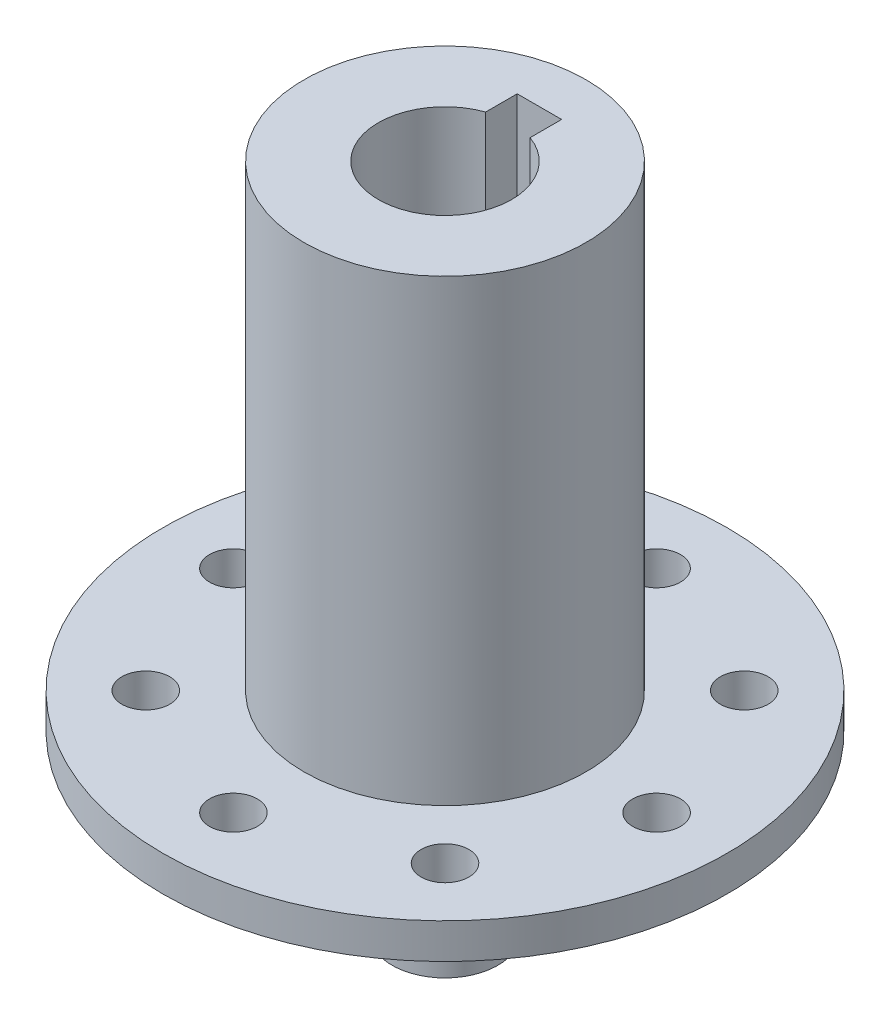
from build123d import *

# Parameters (mm, degrees)
SKETCH1_R                   = 12.7
BOSS_EXTRUDE1_DEPTH         = 41.275
SKETCH3_R                   = 25.4
BOSS_EXTRUDE3_DEPTH         = 3.175
F_8_CLEARANCE_HOLE1_D       = 4.3053
F_20_8MMTOENDOFKEYWAY_DEPTH = 22.0625
SKETCH8_R                   = 4.7625
BOSS_EXTRUDE4_DEPTH         = 15.875
FILLET1_R                   = 5


with BuildPart() as part:
    # Sketch1 → Boss-Extrude1 (new body)
    with BuildSketch(Plane(origin=(0, 0, 0), x_dir=(1, 0, 0), z_dir=(0, 1, 0))):
        with Locations(Location((0, 0, 0), (0, 0, 270))):
            Circle(SKETCH1_R)
    extrude(amount=BOSS_EXTRUDE1_DEPTH)

    # Sketch3 → Boss-Extrude3 (add)
    with BuildSketch(Plane.XZ):
        with Locations(Location((0, 0, 0), (0, 0, 270))):
            Circle(SKETCH3_R)
    extrude(amount=BOSS_EXTRUDE3_DEPTH)

    # 8 Clearance Hole1 (through all)
    with Locations(Plane(origin=(0, -3.175, 0), x_dir=(-1, 0, 0), z_dir=(0, -1, 0))):
        with Locations((0, 19.05), (-13.470384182, 13.470384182), (-19.05, 0), (-13.470384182, -13.470384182), (0, -19.05), (13.470384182, -13.470384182), (19.05, 0), (13.470384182, 13.470384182)):
            Hole(F_8_CLEARANCE_HOLE1_D / 2)

    # Sketch7 → 20.8mmToEndofKeyway (cut)
    with BuildSketch(Plane(origin=(0, 41.275, 0), x_dir=(1, 0, 0), z_dir=(0, 1, 0))):
        with BuildLine():
            Line((-2, 8.5), (2, 8.5))
            Line((2, 8.5), (2, 5.656854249))
            ThreePointArc((2, 5.656854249), (0, -6), (-2, 5.656854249))
            Line((-2, 5.656854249), (-2, 8.5))
        make_face()
    extrude(amount=-F_20_8MMTOENDOFKEYWAY_DEPTH, mode=Mode.SUBTRACT)

    # Sketch8 → Boss-Extrude4 (add)
    with BuildSketch(Plane.XZ.offset(3.175)):
        with Locations(Location((0, 0, 0), (0, 0, 270))):
            Circle(SKETCH8_R)
    extrude(amount=BOSS_EXTRUDE4_DEPTH)

    # Fillet1
    fillet1_edges = [part.edges().sort_by_distance(p)[0] for p in [
        (0, -3.175, 4.7625),
    ]]
    fillet(fillet1_edges, radius=FILLET1_R)


solid = part.part
